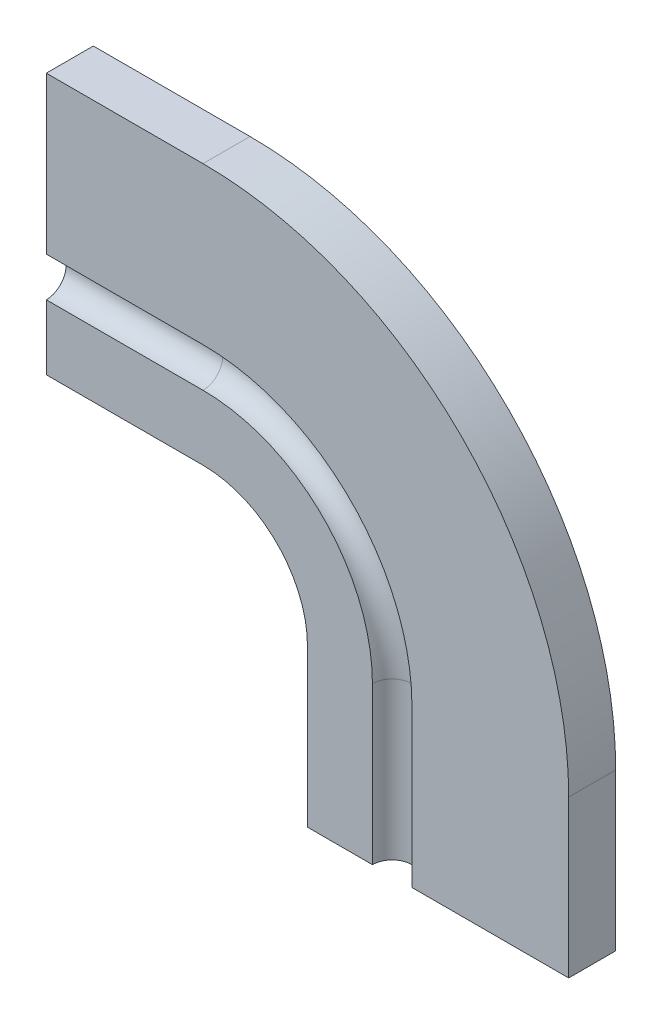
ISO-10303-21;
HEADER;
FILE_DESCRIPTION(('STEP AP214'),'2;1');
FILE_NAME('part.step','',(''),(''),'','','');
FILE_SCHEMA(('AUTOMOTIVE_DESIGN { 1 0 10303 214 1 1 1 1 }'));
ENDSEC;
DATA;
#1=APPLICATION_CONTEXT('core data for automotive mechanical design processes');
#2=APPLICATION_PROTOCOL_DEFINITION('international standard','automotive_design',2000,#1);
#3=PRODUCT_CONTEXT('',#1,'mechanical');
#4=PRODUCT('Part','Part','',(#3));
#5=PRODUCT_RELATED_PRODUCT_CATEGORY('part','',(#4));
#6=PRODUCT_DEFINITION_FORMATION('','',#4);
#7=PRODUCT_DEFINITION_CONTEXT('part definition',#1,'design');
#8=PRODUCT_DEFINITION('design','',#6,#7);
#9=PRODUCT_DEFINITION_SHAPE('','',#8);
#10=(LENGTH_UNIT() NAMED_UNIT(*) SI_UNIT(.MILLI.,.METRE.));
#11=(NAMED_UNIT(*) PLANE_ANGLE_UNIT() SI_UNIT($,.RADIAN.));
#12=(NAMED_UNIT(*) SI_UNIT($,.STERADIAN.) SOLID_ANGLE_UNIT());
#13=UNCERTAINTY_MEASURE_WITH_UNIT(LENGTH_MEASURE(1.E-05),#10,'distance_accuracy_value','');
#14=(GEOMETRIC_REPRESENTATION_CONTEXT(3) GLOBAL_UNCERTAINTY_ASSIGNED_CONTEXT((#13)) GLOBAL_UNIT_ASSIGNED_CONTEXT((#10,
#11,#12)) REPRESENTATION_CONTEXT('',''));
#15=CARTESIAN_POINT('',(0.,0.,0.));
#16=DIRECTION('',(0.,0.,1.));
#17=DIRECTION('',(1.,0.,0.));
#18=AXIS2_PLACEMENT_3D('',#15,#16,#17);
#19=CARTESIAN_POINT('',(51.214,-20.,-1.214));
#20=DIRECTION('',(1.,0.,0.));
#21=DIRECTION('',(0.,0.,-1.));
#22=AXIS2_PLACEMENT_3D('',#19,#20,#21);
#23=PLANE('',#22);
#24=DIRECTION('',(0.,0.,1.));
#25=VECTOR('',#24,1.);
#26=CARTESIAN_POINT('',(51.214,-20.,-1.214));
#27=LINE('',#26,#25);
#28=CARTESIAN_POINT('',(51.214,-20.,-9.));
#29=VERTEX_POINT('',#28);
#30=CARTESIAN_POINT('',(51.214,-20.,-1.214));
#31=VERTEX_POINT('',#30);
#32=EDGE_CURVE('E237',#29,#31,#27,.T.);
#33=ORIENTED_EDGE('',*,*,#32,.T.);
#34=DIRECTION('',(0.,-1.,0.));
#35=VECTOR('',#34,1.);
#36=CARTESIAN_POINT('',(51.214,-20.,-1.214));
#37=LINE('',#36,#35);
#38=CARTESIAN_POINT('',(51.214,-50.,-1.214));
#39=VERTEX_POINT('',#38);
#40=EDGE_CURVE('E327',#31,#39,#37,.T.);
#41=ORIENTED_EDGE('',*,*,#40,.T.);
#42=DIRECTION('',(0.,0.,1.));
#43=VECTOR('',#42,1.);
#44=CARTESIAN_POINT('',(51.214,-50.,-1.214));
#45=LINE('',#44,#43);
#46=CARTESIAN_POINT('',(51.214,-50.,-9.));
#47=VERTEX_POINT('',#46);
#48=EDGE_CURVE('E52',#47,#39,#45,.T.);
#49=ORIENTED_EDGE('',*,*,#48,.F.);
#50=DIRECTION('',(0.,-1.,0.));
#51=VECTOR('',#50,1.);
#52=CARTESIAN_POINT('',(51.214,-20.,-9.));
#53=LINE('',#52,#51);
#54=EDGE_CURVE('E37',#29,#47,#53,.T.);
#55=ORIENTED_EDGE('',*,*,#54,.F.);
#56=EDGE_LOOP('',(#33,#41,#49,#55));
#57=FACE_BOUND('',#56,.T.);
#58=ADVANCED_FACE('F30',(#57),#23,.T.);
#59=CARTESIAN_POINT('',(66.214,-20.,0.));
#60=DIRECTION('',(0.,-1.,0.));
#61=DIRECTION('',(0.,0.,-1.));
#62=AXIS2_PLACEMENT_3D('',#59,#60,#61);
#63=CYLINDRICAL_SURFACE('',#62,5.);
#64=CARTESIAN_POINT('',(66.214,-20.,0.));
#65=DIRECTION('',(0.,-1.,0.));
#66=DIRECTION('',(0.,0.,1.));
#67=AXIS2_PLACEMENT_3D('',#64,#65,#66);
#68=CIRCLE('',#67,5.);
#69=CARTESIAN_POINT('',(61.3636181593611,-20.,-1.214));
#70=VERTEX_POINT('',#69);
#71=CARTESIAN_POINT('',(71.0643818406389,-20.,-1.214));
#72=VERTEX_POINT('',#71);
#73=EDGE_CURVE('E234',#70,#72,#68,.T.);
#74=ORIENTED_EDGE('',*,*,#73,.T.);
#75=DIRECTION('',(0.,-1.,0.));
#76=VECTOR('',#75,1.);
#77=CARTESIAN_POINT('',(71.0643818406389,-20.,-1.214));
#78=LINE('',#77,#76);
#79=CARTESIAN_POINT('',(71.0643818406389,-50.,-1.214));
#80=VERTEX_POINT('',#79);
#81=EDGE_CURVE('E321',#72,#80,#78,.T.);
#82=ORIENTED_EDGE('',*,*,#81,.T.);
#83=CARTESIAN_POINT('',(66.214,-50.,0.));
#84=DIRECTION('',(0.,-1.,0.));
#85=DIRECTION('',(0.,0.,1.));
#86=AXIS2_PLACEMENT_3D('',#83,#84,#85);
#87=CIRCLE('',#86,5.);
#88=CARTESIAN_POINT('',(61.3636181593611,-50.,-1.214));
#89=VERTEX_POINT('',#88);
#90=EDGE_CURVE('E292',#89,#80,#87,.T.);
#91=ORIENTED_EDGE('',*,*,#90,.F.);
#92=DIRECTION('',(0.,-1.,0.));
#93=VECTOR('',#92,1.);
#94=CARTESIAN_POINT('',(61.3636181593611,-20.,-1.214));
#95=LINE('',#94,#93);
#96=EDGE_CURVE('E324',#70,#89,#95,.T.);
#97=ORIENTED_EDGE('',*,*,#96,.F.);
#98=EDGE_LOOP('',(#74,#82,#91,#97));
#99=FACE_BOUND('',#98,.T.);
#100=ADVANCED_FACE('F452',(#99),#63,.T.);
#101=CARTESIAN_POINT('',(98.786,-20.,-9.00000000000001));
#102=DIRECTION('',(-1.,0.,0.));
#103=DIRECTION('',(0.,0.,1.));
#104=AXIS2_PLACEMENT_3D('',#101,#102,#103);
#105=PLANE('',#104);
#106=DIRECTION('',(0.,0.,-1.));
#107=VECTOR('',#106,1.);
#108=CARTESIAN_POINT('',(98.786,-20.,-9.00000000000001));
#109=LINE('',#108,#107);
#110=CARTESIAN_POINT('',(98.786,-20.,-1.21399999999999));
#111=VERTEX_POINT('',#110);
#112=CARTESIAN_POINT('',(98.786,-20.,-9.00000000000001));
#113=VERTEX_POINT('',#112);
#114=EDGE_CURVE('E231',#111,#113,#109,.T.);
#115=ORIENTED_EDGE('',*,*,#114,.T.);
#116=DIRECTION('',(0.,-1.,0.));
#117=VECTOR('',#116,1.);
#118=CARTESIAN_POINT('',(98.786,-20.,-9.00000000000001));
#119=LINE('',#118,#117);
#120=CARTESIAN_POINT('',(98.786,-50.,-9.00000000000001));
#121=VERTEX_POINT('',#120);
#122=EDGE_CURVE('E315',#113,#121,#119,.T.);
#123=ORIENTED_EDGE('',*,*,#122,.T.);
#124=DIRECTION('',(0.,0.,-1.));
#125=VECTOR('',#124,1.);
#126=CARTESIAN_POINT('',(98.786,-50.,-9.00000000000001));
#127=LINE('',#126,#125);
#128=CARTESIAN_POINT('',(98.786,-50.,-1.21399999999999));
#129=VERTEX_POINT('',#128);
#130=EDGE_CURVE('E286',#129,#121,#127,.T.);
#131=ORIENTED_EDGE('',*,*,#130,.F.);
#132=DIRECTION('',(0.,-1.,0.));
#133=VECTOR('',#132,1.);
#134=CARTESIAN_POINT('',(98.786,-20.,-1.21399999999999));
#135=LINE('',#134,#133);
#136=EDGE_CURVE('E318',#111,#129,#135,.T.);
#137=ORIENTED_EDGE('',*,*,#136,.F.);
#138=EDGE_LOOP('',(#115,#123,#131,#137));
#139=FACE_BOUND('',#138,.T.);
#140=ADVANCED_FACE('F455',(#139),#105,.T.);
#141=CARTESIAN_POINT('',(100.,-20.,-9.00000000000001));
#142=DIRECTION('',(1.,0.,0.));
#143=DIRECTION('',(0.,0.,-1.));
#144=AXIS2_PLACEMENT_3D('',#141,#142,#143);
#145=PLANE('',#144);
#146=DIRECTION('',(0.,0.,1.));
#147=VECTOR('',#146,1.);
#148=CARTESIAN_POINT('',(100.,-20.,-9.00000000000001));
#149=LINE('',#148,#147);
#150=CARTESIAN_POINT('',(100.,-20.,-9.00000000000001));
#151=VERTEX_POINT('',#150);
#152=CARTESIAN_POINT('',(100.,-20.,0.));
#153=VERTEX_POINT('',#152);
#154=EDGE_CURVE('E228',#151,#153,#149,.T.);
#155=ORIENTED_EDGE('',*,*,#154,.T.);
#156=DIRECTION('',(0.,-1.,0.));
#157=VECTOR('',#156,1.);
#158=CARTESIAN_POINT('',(100.,-20.,0.));
#159=LINE('',#158,#157);
#160=CARTESIAN_POINT('',(100.,-50.,0.));
#161=VERTEX_POINT('',#160);
#162=EDGE_CURVE('E309',#153,#161,#159,.T.);
#163=ORIENTED_EDGE('',*,*,#162,.T.);
#164=DIRECTION('',(0.,0.,1.));
#165=VECTOR('',#164,1.);
#166=CARTESIAN_POINT('',(100.,-50.,-9.00000000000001));
#167=LINE('',#166,#165);
#168=CARTESIAN_POINT('',(100.,-50.,-9.00000000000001));
#169=VERTEX_POINT('',#168);
#170=EDGE_CURVE('E280',#169,#161,#167,.T.);
#171=ORIENTED_EDGE('',*,*,#170,.F.);
#172=DIRECTION('',(0.,-1.,0.));
#173=VECTOR('',#172,1.);
#174=CARTESIAN_POINT('',(100.,-20.,-9.00000000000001));
#175=LINE('',#174,#173);
#176=EDGE_CURVE('E312',#151,#169,#175,.T.);
#177=ORIENTED_EDGE('',*,*,#176,.F.);
#178=EDGE_LOOP('',(#155,#163,#171,#177));
#179=FACE_BOUND('',#178,.T.);
#180=ADVANCED_FACE('F474',(#179),#145,.T.);
#181=CARTESIAN_POINT('',(66.214,-20.,0.));
#182=DIRECTION('',(0.,-1.,0.));
#183=DIRECTION('',(0.,0.,-1.));
#184=AXIS2_PLACEMENT_3D('',#181,#182,#183);
#185=CYLINDRICAL_SURFACE('',#184,3.786);
#186=CARTESIAN_POINT('',(66.214,-20.,0.));
#187=DIRECTION('',(0.,1.,0.));
#188=DIRECTION('',(0.,0.,-1.));
#189=AXIS2_PLACEMENT_3D('',#186,#187,#188);
#190=CIRCLE('',#189,3.786);
#191=CARTESIAN_POINT('',(70.,-20.,0.));
#192=VERTEX_POINT('',#191);
#193=CARTESIAN_POINT('',(62.428,-20.,0.));
#194=VERTEX_POINT('',#193);
#195=EDGE_CURVE('E219',#192,#194,#190,.T.);
#196=ORIENTED_EDGE('',*,*,#195,.T.);
#197=DIRECTION('',(0.,-1.,0.));
#198=VECTOR('',#197,1.);
#199=CARTESIAN_POINT('',(62.428,-20.,0.));
#200=LINE('',#199,#198);
#201=CARTESIAN_POINT('',(62.428,-50.,0.));
#202=VERTEX_POINT('',#201);
#203=EDGE_CURVE('E303',#194,#202,#200,.T.);
#204=ORIENTED_EDGE('',*,*,#203,.T.);
#205=CARTESIAN_POINT('',(66.214,-50.,0.));
#206=DIRECTION('',(0.,1.,0.));
#207=DIRECTION('',(0.,0.,-1.));
#208=AXIS2_PLACEMENT_3D('',#205,#206,#207);
#209=CIRCLE('',#208,3.786);
#210=CARTESIAN_POINT('',(70.,-50.,0.));
#211=VERTEX_POINT('',#210);
#212=EDGE_CURVE('E274',#211,#202,#209,.T.);
#213=ORIENTED_EDGE('',*,*,#212,.F.);
#214=DIRECTION('',(0.,-1.,0.));
#215=VECTOR('',#214,1.);
#216=CARTESIAN_POINT('',(70.,-20.,0.));
#217=LINE('',#216,#215);
#218=EDGE_CURVE('E306',#192,#211,#217,.T.);
#219=ORIENTED_EDGE('',*,*,#218,.F.);
#220=EDGE_LOOP('',(#196,#204,#213,#219));
#221=FACE_BOUND('',#220,.T.);
#222=ADVANCED_FACE('F479',(#221),#185,.F.);
#223=CARTESIAN_POINT('',(50.,-20.,-9.));
#224=DIRECTION('',(-1.,0.,0.));
#225=DIRECTION('',(0.,0.,1.));
#226=AXIS2_PLACEMENT_3D('',#223,#224,#225);
#227=PLANE('',#226);
#228=DIRECTION('',(0.,0.,-1.));
#229=VECTOR('',#228,1.);
#230=CARTESIAN_POINT('',(50.,-20.,-9.));
#231=LINE('',#230,#229);
#232=CARTESIAN_POINT('',(50.,-20.,0.));
#233=VERTEX_POINT('',#232);
#234=CARTESIAN_POINT('',(50.,-20.,-9.));
#235=VERTEX_POINT('',#234);
#236=EDGE_CURVE('E216',#233,#235,#231,.T.);
#237=ORIENTED_EDGE('',*,*,#236,.T.);
#238=DIRECTION('',(0.,-1.,0.));
#239=VECTOR('',#238,1.);
#240=CARTESIAN_POINT('',(50.,-20.,-9.));
#241=LINE('',#240,#239);
#242=CARTESIAN_POINT('',(50.,-50.,-9.));
#243=VERTEX_POINT('',#242);
#244=EDGE_CURVE('E11',#235,#243,#241,.T.);
#245=ORIENTED_EDGE('',*,*,#244,.T.);
#246=DIRECTION('',(0.,0.,-1.));
#247=VECTOR('',#246,1.);
#248=CARTESIAN_POINT('',(50.,-50.,-9.));
#249=LINE('',#248,#247);
#250=CARTESIAN_POINT('',(50.,-50.,0.));
#251=VERTEX_POINT('',#250);
#252=EDGE_CURVE('E199',#251,#243,#249,.T.);
#253=ORIENTED_EDGE('',*,*,#252,.F.);
#254=DIRECTION('',(0.,-1.,0.));
#255=VECTOR('',#254,1.);
#256=CARTESIAN_POINT('',(50.,-20.,0.));
#257=LINE('',#256,#255);
#258=EDGE_CURVE('E300',#233,#251,#257,.T.);
#259=ORIENTED_EDGE('',*,*,#258,.F.);
#260=EDGE_LOOP('',(#237,#245,#253,#259));
#261=FACE_BOUND('',#260,.T.);
#262=ADVANCED_FACE('F342',(#261),#227,.T.);
#263=CARTESIAN_POINT('',(30.,-20.,0.));
#264=DIRECTION('',(0.,0.,-1.));
#265=DIRECTION('',(-1.,0.,0.));
#266=AXIS2_PLACEMENT_3D('',#263,#264,#265);
#267=CYLINDRICAL_SURFACE('',#266,21.214);
#268=DIRECTION('',(0.,0.,1.));
#269=VECTOR('',#268,1.);
#270=CARTESIAN_POINT('',(30.,1.214,-1.214));
#271=LINE('',#270,#269);
#272=CARTESIAN_POINT('',(30.,1.214,-9.));
#273=VERTEX_POINT('',#272);
#274=CARTESIAN_POINT('',(30.,1.214,-1.214));
#275=VERTEX_POINT('',#274);
#276=EDGE_CURVE('E210',#273,#275,#271,.T.);
#277=ORIENTED_EDGE('',*,*,#276,.T.);
#278=CARTESIAN_POINT('',(30.,-20.,-1.214));
#279=DIRECTION('',(0.,0.,-1.));
#280=DIRECTION('',(-1.,0.,0.));
#281=AXIS2_PLACEMENT_3D('',#278,#279,#280);
#282=CIRCLE('',#281,21.214);
#283=EDGE_CURVE('E265',#275,#31,#282,.T.);
#284=ORIENTED_EDGE('',*,*,#283,.T.);
#285=ORIENTED_EDGE('',*,*,#32,.F.);
#286=CARTESIAN_POINT('',(30.,-20.,-9.));
#287=DIRECTION('',(0.,0.,-1.));
#288=DIRECTION('',(-1.,0.,0.));
#289=AXIS2_PLACEMENT_3D('',#286,#287,#288);
#290=CIRCLE('',#289,21.214);
#291=EDGE_CURVE('E200',#273,#29,#290,.T.);
#292=ORIENTED_EDGE('',*,*,#291,.F.);
#293=EDGE_LOOP('',(#277,#284,#285,#292));
#294=FACE_BOUND('',#293,.T.);
#295=ADVANCED_FACE('F332',(#294),#267,.T.);
#296=CARTESIAN_POINT('',(30.,-20.,0.));
#297=DIRECTION('',(0.,0.,-1.));
#298=DIRECTION('',(-1.,0.,0.));
#299=AXIS2_PLACEMENT_3D('',#296,#297,#298);
#300=TOROIDAL_SURFACE('',#299,36.214,5.);
#301=CARTESIAN_POINT('',(30.,16.214,0.));
#302=DIRECTION('',(1.,0.,0.));
#303=DIRECTION('',(0.,0.,1.));
#304=AXIS2_PLACEMENT_3D('',#301,#302,#303);
#305=CIRCLE('',#304,5.);
#306=CARTESIAN_POINT('',(30.,11.3636181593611,-1.214));
#307=VERTEX_POINT('',#306);
#308=CARTESIAN_POINT('',(30.,21.0643818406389,-1.214));
#309=VERTEX_POINT('',#308);
#310=EDGE_CURVE('E386',#307,#309,#305,.T.);
#311=ORIENTED_EDGE('',*,*,#310,.T.);
#312=CARTESIAN_POINT('',(30.,-20.,-1.214));
#313=DIRECTION('',(0.,0.,-1.));
#314=DIRECTION('',(-1.,0.,0.));
#315=AXIS2_PLACEMENT_3D('',#312,#313,#314);
#316=CIRCLE('',#315,41.0643818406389);
#317=EDGE_CURVE('E259',#309,#72,#316,.T.);
#318=ORIENTED_EDGE('',*,*,#317,.T.);
#319=ORIENTED_EDGE('',*,*,#73,.F.);
#320=CARTESIAN_POINT('',(30.,-20.,-1.214));
#321=DIRECTION('',(0.,0.,-1.));
#322=DIRECTION('',(-1.,0.,0.));
#323=AXIS2_PLACEMENT_3D('',#320,#321,#322);
#324=CIRCLE('',#323,31.3636181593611);
#325=EDGE_CURVE('E262',#307,#70,#324,.T.);
#326=ORIENTED_EDGE('',*,*,#325,.F.);
#327=EDGE_LOOP('',(#311,#318,#319,#326));
#328=FACE_BOUND('',#327,.T.);
#329=ADVANCED_FACE('F450',(#328),#300,.T.);
#330=CARTESIAN_POINT('',(30.,-20.,0.));
#331=DIRECTION('',(0.,0.,-1.));
#332=DIRECTION('',(-1.,0.,0.));
#333=AXIS2_PLACEMENT_3D('',#330,#331,#332);
#334=CYLINDRICAL_SURFACE('',#333,68.786);
#335=DIRECTION('',(0.,0.,-1.));
#336=VECTOR('',#335,1.);
#337=CARTESIAN_POINT('',(30.,48.786,-9.00000000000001));
#338=LINE('',#337,#336);
#339=CARTESIAN_POINT('',(30.,48.786,-1.21399999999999));
#340=VERTEX_POINT('',#339);
#341=CARTESIAN_POINT('',(30.,48.786,-9.00000000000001));
#342=VERTEX_POINT('',#341);
#343=EDGE_CURVE('E422',#340,#342,#338,.T.);
#344=ORIENTED_EDGE('',*,*,#343,.T.);
#345=CARTESIAN_POINT('',(30.,-20.,-9.00000000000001));
#346=DIRECTION('',(0.,0.,-1.));
#347=DIRECTION('',(-1.,0.,0.));
#348=AXIS2_PLACEMENT_3D('',#345,#346,#347);
#349=CIRCLE('',#348,68.786);
#350=EDGE_CURVE('E253',#342,#113,#349,.T.);
#351=ORIENTED_EDGE('',*,*,#350,.T.);
#352=ORIENTED_EDGE('',*,*,#114,.F.);
#353=CARTESIAN_POINT('',(30.,-20.,-1.21399999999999));
#354=DIRECTION('',(0.,0.,-1.));
#355=DIRECTION('',(-1.,0.,0.));
#356=AXIS2_PLACEMENT_3D('',#353,#354,#355);
#357=CIRCLE('',#356,68.786);
#358=EDGE_CURVE('E256',#340,#111,#357,.T.);
#359=ORIENTED_EDGE('',*,*,#358,.F.);
#360=EDGE_LOOP('',(#344,#351,#352,#359));
#361=FACE_BOUND('',#360,.T.);
#362=ADVANCED_FACE('F457',(#361),#334,.F.);
#363=CARTESIAN_POINT('',(30.,-20.,0.));
#364=DIRECTION('',(0.,0.,-1.));
#365=DIRECTION('',(-1.,0.,0.));
#366=AXIS2_PLACEMENT_3D('',#363,#364,#365);
#367=CYLINDRICAL_SURFACE('',#366,70.);
#368=DIRECTION('',(0.,0.,1.));
#369=VECTOR('',#368,1.);
#370=CARTESIAN_POINT('',(30.,50.,-9.00000000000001));
#371=LINE('',#370,#369);
#372=CARTESIAN_POINT('',(30.,50.,-9.00000000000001));
#373=VERTEX_POINT('',#372);
#374=CARTESIAN_POINT('',(30.,50.,0.));
#375=VERTEX_POINT('',#374);
#376=EDGE_CURVE('E354',#373,#375,#371,.T.);
#377=ORIENTED_EDGE('',*,*,#376,.T.);
#378=CARTESIAN_POINT('',(30.,-20.,0.));
#379=DIRECTION('',(0.,0.,-1.));
#380=DIRECTION('',(-1.,0.,0.));
#381=AXIS2_PLACEMENT_3D('',#378,#379,#380);
#382=CIRCLE('',#381,70.);
#383=EDGE_CURVE('E247',#375,#153,#382,.T.);
#384=ORIENTED_EDGE('',*,*,#383,.T.);
#385=ORIENTED_EDGE('',*,*,#154,.F.);
#386=CARTESIAN_POINT('',(30.,-20.,-9.00000000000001));
#387=DIRECTION('',(0.,0.,-1.));
#388=DIRECTION('',(-1.,0.,0.));
#389=AXIS2_PLACEMENT_3D('',#386,#387,#388);
#390=CIRCLE('',#389,70.);
#391=EDGE_CURVE('E250',#373,#151,#390,.T.);
#392=ORIENTED_EDGE('',*,*,#391,.F.);
#393=EDGE_LOOP('',(#377,#384,#385,#392));
#394=FACE_BOUND('',#393,.T.);
#395=ADVANCED_FACE('F430',(#394),#367,.T.);
#396=CARTESIAN_POINT('',(30.,-20.,0.));
#397=DIRECTION('',(0.,0.,-1.));
#398=DIRECTION('',(-1.,0.,0.));
#399=AXIS2_PLACEMENT_3D('',#396,#397,#398);
#400=TOROIDAL_SURFACE('',#399,36.214,3.786);
#401=CARTESIAN_POINT('',(30.,16.214,0.));
#402=DIRECTION('',(-1.,0.,0.));
#403=DIRECTION('',(0.,0.,-1.));
#404=AXIS2_PLACEMENT_3D('',#401,#402,#403);
#405=CIRCLE('',#404,3.786);
#406=CARTESIAN_POINT('',(30.,20.,0.));
#407=VERTEX_POINT('',#406);
#408=CARTESIAN_POINT('',(30.,12.428,0.));
#409=VERTEX_POINT('',#408);
#410=EDGE_CURVE('E349',#407,#409,#405,.T.);
#411=ORIENTED_EDGE('',*,*,#410,.T.);
#412=CARTESIAN_POINT('',(30.,-20.,0.));
#413=DIRECTION('',(0.,0.,-1.));
#414=DIRECTION('',(-1.,0.,0.));
#415=AXIS2_PLACEMENT_3D('',#412,#413,#414);
#416=CIRCLE('',#415,32.428);
#417=EDGE_CURVE('E241',#409,#194,#416,.T.);
#418=ORIENTED_EDGE('',*,*,#417,.T.);
#419=ORIENTED_EDGE('',*,*,#195,.F.);
#420=CARTESIAN_POINT('',(30.,-20.,0.));
#421=DIRECTION('',(0.,0.,-1.));
#422=DIRECTION('',(-1.,0.,0.));
#423=AXIS2_PLACEMENT_3D('',#420,#421,#422);
#424=CIRCLE('',#423,40.);
#425=EDGE_CURVE('E244',#407,#192,#424,.T.);
#426=ORIENTED_EDGE('',*,*,#425,.F.);
#427=EDGE_LOOP('',(#411,#418,#419,#426));
#428=FACE_BOUND('',#427,.T.);
#429=ADVANCED_FACE('F464',(#428),#400,.F.);
#430=CARTESIAN_POINT('',(30.,-20.,0.));
#431=DIRECTION('',(0.,0.,-1.));
#432=DIRECTION('',(-1.,0.,0.));
#433=AXIS2_PLACEMENT_3D('',#430,#431,#432);
#434=CYLINDRICAL_SURFACE('',#433,20.);
#435=DIRECTION('',(0.,0.,-1.));
#436=VECTOR('',#435,1.);
#437=CARTESIAN_POINT('',(30.,0.,-9.));
#438=LINE('',#437,#436);
#439=CARTESIAN_POINT('',(30.,0.,0.));
#440=VERTEX_POINT('',#439);
#441=CARTESIAN_POINT('',(30.,0.,-9.));
#442=VERTEX_POINT('',#441);
#443=EDGE_CURVE('E203',#440,#442,#438,.T.);
#444=ORIENTED_EDGE('',*,*,#443,.T.);
#445=CARTESIAN_POINT('',(30.,-20.,-9.));
#446=DIRECTION('',(0.,0.,-1.));
#447=DIRECTION('',(-1.,0.,0.));
#448=AXIS2_PLACEMENT_3D('',#445,#446,#447);
#449=CIRCLE('',#448,20.);
#450=EDGE_CURVE('E190',#442,#235,#449,.T.);
#451=ORIENTED_EDGE('',*,*,#450,.T.);
#452=ORIENTED_EDGE('',*,*,#236,.F.);
#453=CARTESIAN_POINT('',(30.,-20.,0.));
#454=DIRECTION('',(0.,0.,-1.));
#455=DIRECTION('',(-1.,0.,0.));
#456=AXIS2_PLACEMENT_3D('',#453,#454,#455);
#457=CIRCLE('',#456,20.);
#458=EDGE_CURVE('E206',#440,#233,#457,.T.);
#459=ORIENTED_EDGE('',*,*,#458,.F.);
#460=EDGE_LOOP('',(#444,#451,#452,#459));
#461=FACE_BOUND('',#460,.T.);
#462=ADVANCED_FACE('F204',(#461),#434,.F.);
#463=CARTESIAN_POINT('',(30.,0.,-9.));
#464=DIRECTION('',(0.,1.,0.));
#465=DIRECTION('',(-1.,0.,0.));
#466=AXIS2_PLACEMENT_3D('',#463,#464,#465);
#467=PLANE('',#466);
#468=DIRECTION('',(0.,0.,-1.));
#469=VECTOR('',#468,1.);
#470=CARTESIAN_POINT('',(0.,0.,-9.));
#471=LINE('',#470,#469);
#472=CARTESIAN_POINT('',(0.,0.,0.));
#473=VERTEX_POINT('',#472);
#474=CARTESIAN_POINT('',(0.,0.,-9.));
#475=VERTEX_POINT('',#474);
#476=EDGE_CURVE('E215',#473,#475,#471,.T.);
#477=ORIENTED_EDGE('',*,*,#476,.T.);
#478=DIRECTION('',(-1.,0.,0.));
#479=VECTOR('',#478,1.);
#480=CARTESIAN_POINT('',(30.,0.,-9.));
#481=LINE('',#480,#479);
#482=EDGE_CURVE('E194',#442,#475,#481,.T.);
#483=ORIENTED_EDGE('',*,*,#482,.F.);
#484=ORIENTED_EDGE('',*,*,#443,.F.);
#485=DIRECTION('',(-1.,0.,0.));
#486=VECTOR('',#485,1.);
#487=CARTESIAN_POINT('',(30.,0.,0.));
#488=LINE('',#487,#486);
#489=EDGE_CURVE('E345',#440,#473,#488,.T.);
#490=ORIENTED_EDGE('',*,*,#489,.T.);
#491=EDGE_LOOP('',(#477,#483,#484,#490));
#492=FACE_BOUND('',#491,.T.);
#493=ADVANCED_FACE('F213',(#492),#467,.F.);
#494=CARTESIAN_POINT('',(30.,1.214,-9.));
#495=DIRECTION('',(0.,0.,1.));
#496=DIRECTION('',(1.,0.,0.));
#497=AXIS2_PLACEMENT_3D('',#494,#495,#496);
#498=PLANE('',#497);
#499=DIRECTION('',(0.,1.,0.));
#500=VECTOR('',#499,1.);
#501=CARTESIAN_POINT('',(0.,1.214,-9.));
#502=LINE('',#501,#500);
#503=CARTESIAN_POINT('',(0.,1.214,-9.));
#504=VERTEX_POINT('',#503);
#505=EDGE_CURVE('E415',#475,#504,#502,.T.);
#506=ORIENTED_EDGE('',*,*,#505,.T.);
#507=DIRECTION('',(-1.,0.,0.));
#508=VECTOR('',#507,1.);
#509=CARTESIAN_POINT('',(30.,1.214,-9.));
#510=LINE('',#509,#508);
#511=EDGE_CURVE('E217',#273,#504,#510,.T.);
#512=ORIENTED_EDGE('',*,*,#511,.F.);
#513=ORIENTED_EDGE('',*,*,#291,.T.);
#514=ORIENTED_EDGE('',*,*,#54,.T.);
#515=DIRECTION('',(1.,0.,0.));
#516=VECTOR('',#515,1.);
#517=CARTESIAN_POINT('',(51.214,-50.,-9.));
#518=LINE('',#517,#516);
#519=EDGE_CURVE('E44',#243,#47,#518,.T.);
#520=ORIENTED_EDGE('',*,*,#519,.F.);
#521=ORIENTED_EDGE('',*,*,#244,.F.);
#522=ORIENTED_EDGE('',*,*,#450,.F.);
#523=ORIENTED_EDGE('',*,*,#482,.T.);
#524=EDGE_LOOP('',(#506,#512,#513,#514,#520,#521,#522,#523));
#525=FACE_BOUND('',#524,.T.);
#526=ADVANCED_FACE('F192',(#525),#498,.F.);
#527=CARTESIAN_POINT('',(30.,1.214,-1.214));
#528=DIRECTION('',(0.,-1.,0.));
#529=DIRECTION('',(1.,0.,0.));
#530=AXIS2_PLACEMENT_3D('',#527,#528,#529);
#531=PLANE('',#530);
#532=DIRECTION('',(0.,0.,1.));
#533=VECTOR('',#532,1.);
#534=CARTESIAN_POINT('',(0.,1.214,-1.214));
#535=LINE('',#534,#533);
#536=CARTESIAN_POINT('',(0.,1.214,-1.214));
#537=VERTEX_POINT('',#536);
#538=EDGE_CURVE('E397',#504,#537,#535,.T.);
#539=ORIENTED_EDGE('',*,*,#538,.T.);
#540=DIRECTION('',(-1.,0.,0.));
#541=VECTOR('',#540,1.);
#542=CARTESIAN_POINT('',(30.,1.214,-1.214));
#543=LINE('',#542,#541);
#544=EDGE_CURVE('E222',#275,#537,#543,.T.);
#545=ORIENTED_EDGE('',*,*,#544,.F.);
#546=ORIENTED_EDGE('',*,*,#276,.F.);
#547=ORIENTED_EDGE('',*,*,#511,.T.);
#548=EDGE_LOOP('',(#539,#545,#546,#547));
#549=FACE_BOUND('',#548,.T.);
#550=ADVANCED_FACE('F420',(#549),#531,.F.);
#551=CARTESIAN_POINT('',(30.,11.3636181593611,-1.214));
#552=DIRECTION('',(0.,0.,1.));
#553=DIRECTION('',(0.,-1.,0.));
#554=AXIS2_PLACEMENT_3D('',#551,#552,#553);
#555=PLANE('',#554);
#556=DIRECTION('',(0.,1.,0.));
#557=VECTOR('',#556,1.);
#558=CARTESIAN_POINT('',(0.,11.3636181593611,-1.214));
#559=LINE('',#558,#557);
#560=CARTESIAN_POINT('',(0.,11.3636181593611,-1.214));
#561=VERTEX_POINT('',#560);
#562=EDGE_CURVE('E391',#537,#561,#559,.T.);
#563=ORIENTED_EDGE('',*,*,#562,.T.);
#564=DIRECTION('',(-1.,0.,0.));
#565=VECTOR('',#564,1.);
#566=CARTESIAN_POINT('',(30.,11.3636181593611,-1.214));
#567=LINE('',#566,#565);
#568=EDGE_CURVE('E376',#307,#561,#567,.T.);
#569=ORIENTED_EDGE('',*,*,#568,.F.);
#570=ORIENTED_EDGE('',*,*,#325,.T.);
#571=ORIENTED_EDGE('',*,*,#96,.T.);
#572=DIRECTION('',(1.,0.,0.));
#573=VECTOR('',#572,1.);
#574=CARTESIAN_POINT('',(61.3636181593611,-50.,-1.214));
#575=LINE('',#574,#573);
#576=EDGE_CURVE('E295',#39,#89,#575,.T.);
#577=ORIENTED_EDGE('',*,*,#576,.F.);
#578=ORIENTED_EDGE('',*,*,#40,.F.);
#579=ORIENTED_EDGE('',*,*,#283,.F.);
#580=ORIENTED_EDGE('',*,*,#544,.T.);
#581=EDGE_LOOP('',(#563,#569,#570,#571,#577,#578,#579,#580));
#582=FACE_BOUND('',#581,.T.);
#583=ADVANCED_FACE('F337',(#582),#555,.F.);
#584=CARTESIAN_POINT('',(30.,16.214,0.));
#585=DIRECTION('',(-1.,0.,0.));
#586=DIRECTION('',(0.,-1.,0.));
#587=AXIS2_PLACEMENT_3D('',#584,#585,#586);
#588=CYLINDRICAL_SURFACE('',#587,5.);
#589=CARTESIAN_POINT('',(0.,16.214,0.));
#590=DIRECTION('',(1.,0.,0.));
#591=DIRECTION('',(0.,0.,1.));
#592=AXIS2_PLACEMENT_3D('',#589,#590,#591);
#593=CIRCLE('',#592,5.);
#594=CARTESIAN_POINT('',(0.,21.0643818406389,-1.214));
#595=VERTEX_POINT('',#594);
#596=EDGE_CURVE('E384',#561,#595,#593,.T.);
#597=ORIENTED_EDGE('',*,*,#596,.T.);
#598=DIRECTION('',(-1.,0.,0.));
#599=VECTOR('',#598,1.);
#600=CARTESIAN_POINT('',(30.,21.0643818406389,-1.214));
#601=LINE('',#600,#599);
#602=EDGE_CURVE('E373',#309,#595,#601,.T.);
#603=ORIENTED_EDGE('',*,*,#602,.F.);
#604=ORIENTED_EDGE('',*,*,#310,.F.);
#605=ORIENTED_EDGE('',*,*,#568,.T.);
#606=EDGE_LOOP('',(#597,#603,#604,#605));
#607=FACE_BOUND('',#606,.T.);
#608=ADVANCED_FACE('F382',(#607),#588,.T.);
#609=CARTESIAN_POINT('',(30.,48.786,-1.21399999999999));
#610=DIRECTION('',(0.,0.,1.));
#611=DIRECTION('',(0.,-1.,0.));
#612=AXIS2_PLACEMENT_3D('',#609,#610,#611);
#613=PLANE('',#612);
#614=DIRECTION('',(0.,1.,0.));
#615=VECTOR('',#614,1.);
#616=CARTESIAN_POINT('',(0.,48.786,-1.21399999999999));
#617=LINE('',#616,#615);
#618=CARTESIAN_POINT('',(0.,48.786,-1.21399999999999));
#619=VERTEX_POINT('',#618);
#620=EDGE_CURVE('E393',#595,#619,#617,.T.);
#621=ORIENTED_EDGE('',*,*,#620,.T.);
#622=DIRECTION('',(-1.,0.,0.));
#623=VECTOR('',#622,1.);
#624=CARTESIAN_POINT('',(30.,48.786,-1.21399999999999));
#625=LINE('',#624,#623);
#626=EDGE_CURVE('E370',#340,#619,#625,.T.);
#627=ORIENTED_EDGE('',*,*,#626,.F.);
#628=ORIENTED_EDGE('',*,*,#358,.T.);
#629=ORIENTED_EDGE('',*,*,#136,.T.);
#630=DIRECTION('',(1.,0.,0.));
#631=VECTOR('',#630,1.);
#632=CARTESIAN_POINT('',(98.786,-50.,-1.21399999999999));
#633=LINE('',#632,#631);
#634=EDGE_CURVE('E289',#80,#129,#633,.T.);
#635=ORIENTED_EDGE('',*,*,#634,.F.);
#636=ORIENTED_EDGE('',*,*,#81,.F.);
#637=ORIENTED_EDGE('',*,*,#317,.F.);
#638=ORIENTED_EDGE('',*,*,#602,.T.);
#639=EDGE_LOOP('',(#621,#627,#628,#629,#635,#636,#637,#638));
#640=FACE_BOUND('',#639,.T.);
#641=ADVANCED_FACE('F447',(#640),#613,.F.);
#642=CARTESIAN_POINT('',(30.,48.786,-9.00000000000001));
#643=DIRECTION('',(0.,1.,0.));
#644=DIRECTION('',(-1.,0.,0.));
#645=AXIS2_PLACEMENT_3D('',#642,#643,#644);
#646=PLANE('',#645);
#647=DIRECTION('',(0.,0.,-1.));
#648=VECTOR('',#647,1.);
#649=CARTESIAN_POINT('',(0.,48.786,-9.00000000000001));
#650=LINE('',#649,#648);
#651=CARTESIAN_POINT('',(0.,48.786,-9.00000000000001));
#652=VERTEX_POINT('',#651);
#653=EDGE_CURVE('E395',#619,#652,#650,.T.);
#654=ORIENTED_EDGE('',*,*,#653,.T.);
#655=DIRECTION('',(-1.,0.,0.));
#656=VECTOR('',#655,1.);
#657=CARTESIAN_POINT('',(30.,48.786,-9.00000000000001));
#658=LINE('',#657,#656);
#659=EDGE_CURVE('E367',#342,#652,#658,.T.);
#660=ORIENTED_EDGE('',*,*,#659,.F.);
#661=ORIENTED_EDGE('',*,*,#343,.F.);
#662=ORIENTED_EDGE('',*,*,#626,.T.);
#663=EDGE_LOOP('',(#654,#660,#661,#662));
#664=FACE_BOUND('',#663,.T.);
#665=ADVANCED_FACE('F444',(#664),#646,.F.);
#666=CARTESIAN_POINT('',(30.,50.,-9.00000000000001));
#667=DIRECTION('',(0.,0.,1.));
#668=DIRECTION('',(1.,0.,0.));
#669=AXIS2_PLACEMENT_3D('',#666,#667,#668);
#670=PLANE('',#669);
#671=DIRECTION('',(0.,1.,0.));
#672=VECTOR('',#671,1.);
#673=CARTESIAN_POINT('',(0.,50.,-9.00000000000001));
#674=LINE('',#673,#672);
#675=CARTESIAN_POINT('',(0.,50.,-9.00000000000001));
#676=VERTEX_POINT('',#675);
#677=EDGE_CURVE('E402',#652,#676,#674,.T.);
#678=ORIENTED_EDGE('',*,*,#677,.T.);
#679=DIRECTION('',(-1.,0.,0.));
#680=VECTOR('',#679,1.);
#681=CARTESIAN_POINT('',(30.,50.,-9.00000000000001));
#682=LINE('',#681,#680);
#683=EDGE_CURVE('E364',#373,#676,#682,.T.);
#684=ORIENTED_EDGE('',*,*,#683,.F.);
#685=ORIENTED_EDGE('',*,*,#391,.T.);
#686=ORIENTED_EDGE('',*,*,#176,.T.);
#687=DIRECTION('',(1.,0.,0.));
#688=VECTOR('',#687,1.);
#689=CARTESIAN_POINT('',(100.,-50.,-9.00000000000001));
#690=LINE('',#689,#688);
#691=EDGE_CURVE('E283',#121,#169,#690,.T.);
#692=ORIENTED_EDGE('',*,*,#691,.F.);
#693=ORIENTED_EDGE('',*,*,#122,.F.);
#694=ORIENTED_EDGE('',*,*,#350,.F.);
#695=ORIENTED_EDGE('',*,*,#659,.T.);
#696=EDGE_LOOP('',(#678,#684,#685,#686,#692,#693,#694,#695));
#697=FACE_BOUND('',#696,.T.);
#698=ADVANCED_FACE('F440',(#697),#670,.F.);
#699=CARTESIAN_POINT('',(30.,50.,-9.00000000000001));
#700=DIRECTION('',(0.,-1.,0.));
#701=DIRECTION('',(1.,0.,0.));
#702=AXIS2_PLACEMENT_3D('',#699,#700,#701);
#703=PLANE('',#702);
#704=DIRECTION('',(0.,0.,1.));
#705=VECTOR('',#704,1.);
#706=CARTESIAN_POINT('',(0.,50.,-9.00000000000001));
#707=LINE('',#706,#705);
#708=CARTESIAN_POINT('',(0.,50.,0.));
#709=VERTEX_POINT('',#708);
#710=EDGE_CURVE('E404',#676,#709,#707,.T.);
#711=ORIENTED_EDGE('',*,*,#710,.T.);
#712=DIRECTION('',(-1.,0.,0.));
#713=VECTOR('',#712,1.);
#714=CARTESIAN_POINT('',(30.,50.,0.));
#715=LINE('',#714,#713);
#716=EDGE_CURVE('E361',#375,#709,#715,.T.);
#717=ORIENTED_EDGE('',*,*,#716,.F.);
#718=ORIENTED_EDGE('',*,*,#376,.F.);
#719=ORIENTED_EDGE('',*,*,#683,.T.);
#720=EDGE_LOOP('',(#711,#717,#718,#719));
#721=FACE_BOUND('',#720,.T.);
#722=ADVANCED_FACE('F434',(#721),#703,.F.);
#723=CARTESIAN_POINT('',(30.,20.,0.));
#724=DIRECTION('',(0.,0.,-1.));
#725=DIRECTION('',(-1.,0.,0.));
#726=AXIS2_PLACEMENT_3D('',#723,#724,#725);
#727=PLANE('',#726);
#728=DIRECTION('',(0.,-1.,0.));
#729=VECTOR('',#728,1.);
#730=CARTESIAN_POINT('',(0.,20.,0.));
#731=LINE('',#730,#729);
#732=CARTESIAN_POINT('',(0.,20.,0.));
#733=VERTEX_POINT('',#732);
#734=EDGE_CURVE('E406',#709,#733,#731,.T.);
#735=ORIENTED_EDGE('',*,*,#734,.T.);
#736=DIRECTION('',(-1.,0.,0.));
#737=VECTOR('',#736,1.);
#738=CARTESIAN_POINT('',(30.,20.,0.));
#739=LINE('',#738,#737);
#740=EDGE_CURVE('E351',#407,#733,#739,.T.);
#741=ORIENTED_EDGE('',*,*,#740,.F.);
#742=ORIENTED_EDGE('',*,*,#425,.T.);
#743=ORIENTED_EDGE('',*,*,#218,.T.);
#744=DIRECTION('',(-1.,0.,0.));
#745=VECTOR('',#744,1.);
#746=CARTESIAN_POINT('',(70.,-50.,0.));
#747=LINE('',#746,#745);
#748=EDGE_CURVE('E277',#161,#211,#747,.T.);
#749=ORIENTED_EDGE('',*,*,#748,.F.);
#750=ORIENTED_EDGE('',*,*,#162,.F.);
#751=ORIENTED_EDGE('',*,*,#383,.F.);
#752=ORIENTED_EDGE('',*,*,#716,.T.);
#753=EDGE_LOOP('',(#735,#741,#742,#743,#749,#750,#751,#752));
#754=FACE_BOUND('',#753,.T.);
#755=ADVANCED_FACE('F437',(#754),#727,.F.);
#756=CARTESIAN_POINT('',(30.,16.214,0.));
#757=DIRECTION('',(-1.,0.,0.));
#758=DIRECTION('',(0.,-1.,0.));
#759=AXIS2_PLACEMENT_3D('',#756,#757,#758);
#760=CYLINDRICAL_SURFACE('',#759,3.786);
#761=CARTESIAN_POINT('',(0.,16.214,0.));
#762=DIRECTION('',(-1.,0.,0.));
#763=DIRECTION('',(0.,0.,-1.));
#764=AXIS2_PLACEMENT_3D('',#761,#762,#763);
#765=CIRCLE('',#764,3.786);
#766=CARTESIAN_POINT('',(0.,12.428,0.));
#767=VERTEX_POINT('',#766);
#768=EDGE_CURVE('E407',#733,#767,#765,.T.);
#769=ORIENTED_EDGE('',*,*,#768,.T.);
#770=DIRECTION('',(-1.,0.,0.));
#771=VECTOR('',#770,1.);
#772=CARTESIAN_POINT('',(30.,12.428,0.));
#773=LINE('',#772,#771);
#774=EDGE_CURVE('E348',#409,#767,#773,.T.);
#775=ORIENTED_EDGE('',*,*,#774,.F.);
#776=ORIENTED_EDGE('',*,*,#410,.F.);
#777=ORIENTED_EDGE('',*,*,#740,.T.);
#778=EDGE_LOOP('',(#769,#775,#776,#777));
#779=FACE_BOUND('',#778,.T.);
#780=ADVANCED_FACE('F411',(#779),#760,.F.);
#781=CARTESIAN_POINT('',(30.,0.,0.));
#782=DIRECTION('',(0.,0.,-1.));
#783=DIRECTION('',(-1.,0.,0.));
#784=AXIS2_PLACEMENT_3D('',#781,#782,#783);
#785=PLANE('',#784);
#786=DIRECTION('',(0.,-1.,0.));
#787=VECTOR('',#786,1.);
#788=CARTESIAN_POINT('',(0.,0.,0.));
#789=LINE('',#788,#787);
#790=EDGE_CURVE('E211',#767,#473,#789,.T.);
#791=ORIENTED_EDGE('',*,*,#790,.T.);
#792=ORIENTED_EDGE('',*,*,#489,.F.);
#793=ORIENTED_EDGE('',*,*,#458,.T.);
#794=ORIENTED_EDGE('',*,*,#258,.T.);
#795=DIRECTION('',(-1.,0.,0.));
#796=VECTOR('',#795,1.);
#797=CARTESIAN_POINT('',(50.,-50.,0.));
#798=LINE('',#797,#796);
#799=EDGE_CURVE('E271',#202,#251,#798,.T.);
#800=ORIENTED_EDGE('',*,*,#799,.F.);
#801=ORIENTED_EDGE('',*,*,#203,.F.);
#802=ORIENTED_EDGE('',*,*,#417,.F.);
#803=ORIENTED_EDGE('',*,*,#774,.T.);
#804=EDGE_LOOP('',(#791,#792,#793,#794,#800,#801,#802,#803));
#805=FACE_BOUND('',#804,.T.);
#806=ADVANCED_FACE('F344',(#805),#785,.F.);
#807=CARTESIAN_POINT('',(66.214,-50.,0.));
#808=DIRECTION('',(0.,-1.,0.));
#809=DIRECTION('',(0.,0.,-1.));
#810=AXIS2_PLACEMENT_3D('',#807,#808,#809);
#811=PLANE('',#810);
#812=ORIENTED_EDGE('',*,*,#252,.T.);
#813=ORIENTED_EDGE('',*,*,#519,.T.);
#814=ORIENTED_EDGE('',*,*,#48,.T.);
#815=ORIENTED_EDGE('',*,*,#576,.T.);
#816=ORIENTED_EDGE('',*,*,#90,.T.);
#817=ORIENTED_EDGE('',*,*,#634,.T.);
#818=ORIENTED_EDGE('',*,*,#130,.T.);
#819=ORIENTED_EDGE('',*,*,#691,.T.);
#820=ORIENTED_EDGE('',*,*,#170,.T.);
#821=ORIENTED_EDGE('',*,*,#748,.T.);
#822=ORIENTED_EDGE('',*,*,#212,.T.);
#823=ORIENTED_EDGE('',*,*,#799,.T.);
#824=EDGE_LOOP('',(#812,#813,#814,#815,#816,#817,#818,#819,#820,#821,#822,#823));
#825=FACE_BOUND('',#824,.T.);
#826=ADVANCED_FACE('F340',(#825),#811,.T.);
#827=CARTESIAN_POINT('',(0.,16.214,0.));
#828=DIRECTION('',(1.,0.,0.));
#829=DIRECTION('',(0.,0.,-1.));
#830=AXIS2_PLACEMENT_3D('',#827,#828,#829);
#831=PLANE('',#830);
#832=ORIENTED_EDGE('',*,*,#476,.F.);
#833=ORIENTED_EDGE('',*,*,#790,.F.);
#834=ORIENTED_EDGE('',*,*,#768,.F.);
#835=ORIENTED_EDGE('',*,*,#734,.F.);
#836=ORIENTED_EDGE('',*,*,#710,.F.);
#837=ORIENTED_EDGE('',*,*,#677,.F.);
#838=ORIENTED_EDGE('',*,*,#653,.F.);
#839=ORIENTED_EDGE('',*,*,#620,.F.);
#840=ORIENTED_EDGE('',*,*,#596,.F.);
#841=ORIENTED_EDGE('',*,*,#562,.F.);
#842=ORIENTED_EDGE('',*,*,#538,.F.);
#843=ORIENTED_EDGE('',*,*,#505,.F.);
#844=EDGE_LOOP('',(#832,#833,#834,#835,#836,#837,#838,#839,#840,#841,#842,#843));
#845=FACE_BOUND('',#844,.T.);
#846=ADVANCED_FACE('F389',(#845),#831,.F.);
#847=CLOSED_SHELL('',(#58,#100,#140,#180,#222,#262,#295,#329,#362,#395,#429,#462,#493,#526,#550,
#583,#608,#641,#665,#698,#722,#755,#780,#806,#826,#846));
#848=MANIFOLD_SOLID_BREP('B2',#847);
#849=ADVANCED_BREP_SHAPE_REPRESENTATION('',(#18,#848),#14);
#850=SHAPE_DEFINITION_REPRESENTATION(#9,#849);
ENDSEC;
END-ISO-10303-21;
